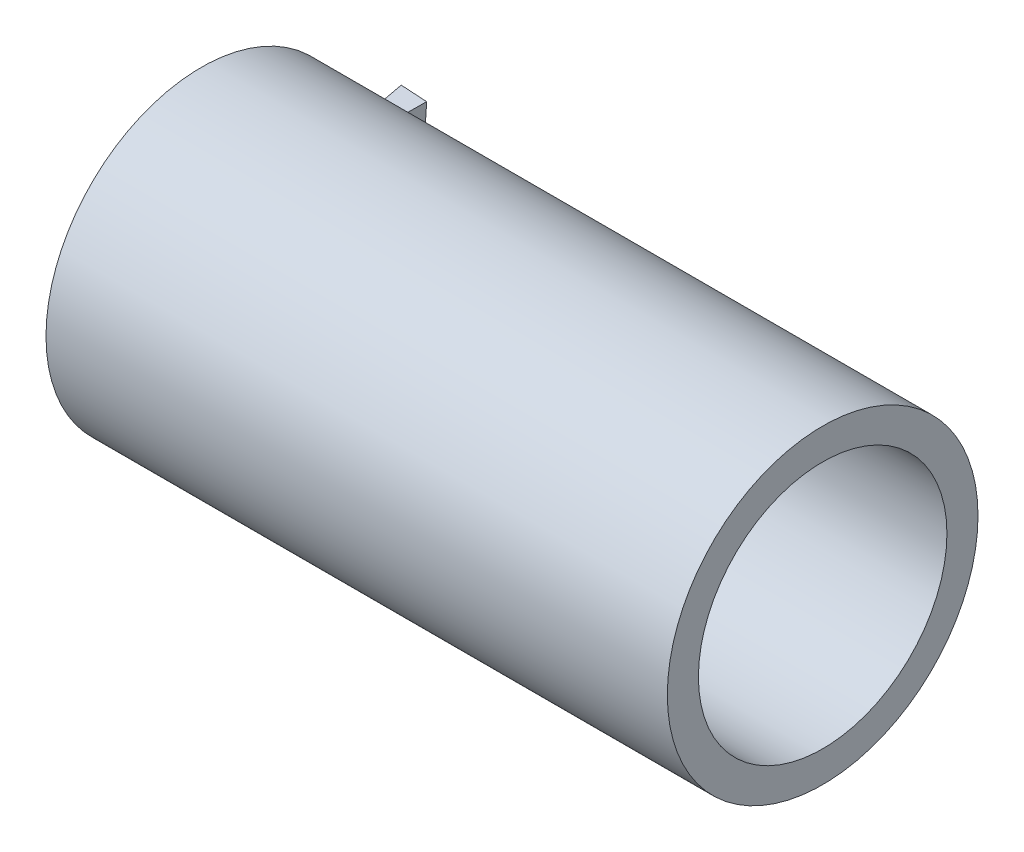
ISO-10303-21;
HEADER;
FILE_DESCRIPTION(('STEP AP214'),'2;1');
FILE_NAME('part.step','',(''),(''),'','','');
FILE_SCHEMA(('AUTOMOTIVE_DESIGN { 1 0 10303 214 1 1 1 1 }'));
ENDSEC;
DATA;
#1=APPLICATION_CONTEXT('core data for automotive mechanical design processes');
#2=APPLICATION_PROTOCOL_DEFINITION('international standard','automotive_design',2000,#1);
#3=PRODUCT_CONTEXT('',#1,'mechanical');
#4=PRODUCT('Part','Part','',(#3));
#5=PRODUCT_RELATED_PRODUCT_CATEGORY('part','',(#4));
#6=PRODUCT_DEFINITION_FORMATION('','',#4);
#7=PRODUCT_DEFINITION_CONTEXT('part definition',#1,'design');
#8=PRODUCT_DEFINITION('design','',#6,#7);
#9=PRODUCT_DEFINITION_SHAPE('','',#8);
#10=(LENGTH_UNIT() NAMED_UNIT(*) SI_UNIT(.MILLI.,.METRE.));
#11=(NAMED_UNIT(*) PLANE_ANGLE_UNIT() SI_UNIT($,.RADIAN.));
#12=(NAMED_UNIT(*) SI_UNIT($,.STERADIAN.) SOLID_ANGLE_UNIT());
#13=UNCERTAINTY_MEASURE_WITH_UNIT(LENGTH_MEASURE(1.E-05),#10,'distance_accuracy_value','');
#14=(GEOMETRIC_REPRESENTATION_CONTEXT(3) GLOBAL_UNCERTAINTY_ASSIGNED_CONTEXT((#13)) GLOBAL_UNIT_ASSIGNED_CONTEXT((#10,
#11,#12)) REPRESENTATION_CONTEXT('',''));
#15=CARTESIAN_POINT('',(0.,0.,0.));
#16=DIRECTION('',(0.,0.,1.));
#17=DIRECTION('',(1.,0.,0.));
#18=AXIS2_PLACEMENT_3D('',#15,#16,#17);
#19=CARTESIAN_POINT('',(0.,20.,0.));
#20=DIRECTION('',(1.,0.,0.));
#21=DIRECTION('',(0.,0.,-1.));
#22=AXIS2_PLACEMENT_3D('',#19,#20,#21);
#23=PLANE('',#22);
#24=CARTESIAN_POINT('',(0.,0.,0.));
#25=DIRECTION('',(1.,0.,0.));
#26=DIRECTION('',(0.,0.,-1.));
#27=AXIS2_PLACEMENT_3D('',#24,#25,#26);
#28=CIRCLE('',#27,25.);
#29=CARTESIAN_POINT('',(0.,0.,-25.));
#30=VERTEX_POINT('',#29);
#31=CARTESIAN_POINT('',(0.,-10.9625472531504,-22.4682566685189));
#32=VERTEX_POINT('',#31);
#33=EDGE_CURVE('E64',#30,#32,#28,.F.);
#34=ORIENTED_EDGE('',*,*,#33,.F.);
#35=DIRECTION('',(0.,0.855797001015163,0.517311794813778));
#36=VECTOR('',#35,1.);
#37=CARTESIAN_POINT('',(0.,-1.92863678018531,-26.1658215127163));
#38=LINE('',#37,#36);
#39=CARTESIAN_POINT('',(9.44111427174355E-06,-1.55724327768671,-25.9414113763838));
#40=VERTEX_POINT('',#39);
#41=EDGE_CURVE('E94',#40,#30,#38,.T.);
#42=ORIENTED_EDGE('',*,*,#41,.F.);
#43=CARTESIAN_POINT('',(0.,-10.9627373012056,-22.469326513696));
#44=CARTESIAN_POINT('',(1.08463683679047E-06,-10.5930481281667,-22.705411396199));
#45=CARTESIAN_POINT('',(1.76324528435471E-05,-10.2166393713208,-22.9309429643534));
#46=CARTESIAN_POINT('',(6.31856095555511E-05,-9.45590871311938,-23.358083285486));
#47=CARTESIAN_POINT('',(9.20522468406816E-05,-9.07171898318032,-23.5599274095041));
#48=CARTESIAN_POINT('',(0.000144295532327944,-8.29718437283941,-23.9399144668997));
#49=CARTESIAN_POINT('',(0.000167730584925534,-7.90695826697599,-24.118299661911));
#50=CARTESIAN_POINT('',(0.000199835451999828,-7.12203124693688,-24.4516559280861));
#51=CARTESIAN_POINT('',(0.000208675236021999,-6.72743651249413,-24.6068770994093));
#52=CARTESIAN_POINT('',(0.000208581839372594,-5.93538064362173,-24.8942412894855));
#53=CARTESIAN_POINT('',(0.000199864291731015,-5.53801329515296,-25.0266428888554));
#54=CARTESIAN_POINT('',(0.000168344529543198,-4.74194545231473,-25.2687544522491));
#55=CARTESIAN_POINT('',(0.00014572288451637,-4.34332621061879,-25.378731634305));
#56=CARTESIAN_POINT('',(9.56847371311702E-05,-3.54621022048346,-25.5764284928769));
#57=CARTESIAN_POINT('',(6.8335741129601E-05,-3.14778183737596,-25.6644237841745));
#58=CARTESIAN_POINT('',(2.59220931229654E-05,-2.35243037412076,-25.8186358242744));
#59=CARTESIAN_POINT('',(1.06933481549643E-05,-1.95556221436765,-25.885135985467));
#60=CARTESIAN_POINT('',(9.44111427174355E-06,-1.55724327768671,-25.9414113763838));
#61=B_SPLINE_CURVE_WITH_KNOTS('',3,(#43,#44,#45,#46,#47,#48,#49,#50,#51,#52,#53,#54,#55,#56,#57,
#58,#59,#60),.UNSPECIFIED.,.F.,.F.,(4,2,2,2,2,2,2,2,4),(0.,1.3157208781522,2.61700285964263,
3.90356596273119,5.17503787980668,6.43098925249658,7.67096474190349,8.89450987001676,
10.1011937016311),.UNSPECIFIED.);
#62=EDGE_CURVE('E57',#40,#32,#61,.F.);
#63=ORIENTED_EDGE('',*,*,#62,.T.);
#64=EDGE_LOOP('',(#34,#42,#63));
#65=FACE_BOUND('',#64,.T.);
#66=ADVANCED_FACE('F44',(#65),#23,.F.);
#67=CARTESIAN_POINT('',(0.150022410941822,2.35654652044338,-25.));
#68=DIRECTION('',(0.0631853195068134,0.992512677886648,0.104528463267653));
#69=DIRECTION('',(0.,-0.104737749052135,0.994499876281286));
#70=AXIS2_PLACEMENT_3D('',#67,#68,#69);
#71=PLANE('',#70);
#72=DIRECTION('',(-0.11035707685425,-0.0971469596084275,0.989132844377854));
#73=VECTOR('',#72,1.);
#74=CARTESIAN_POINT('',(0.0926576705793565,2.30604853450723,-24.4858386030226));
#75=LINE('',#74,#73);
#76=CARTESIAN_POINT('',(0.248480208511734,2.44321858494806,-25.882479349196));
#77=VERTEX_POINT('',#76);
#78=CARTESIAN_POINT('',(0.137717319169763,2.3457143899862,-24.8897091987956));
#79=VERTEX_POINT('',#78);
#80=EDGE_CURVE('E97',#77,#79,#75,.T.);
#81=ORIENTED_EDGE('',*,*,#80,.T.);
#82=CARTESIAN_POINT('',(-4.19132279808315,0.,0.));
#83=DIRECTION('',(0.0631853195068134,0.992512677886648,0.104528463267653));
#84=DIRECTION('',(-0.998001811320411,0.0628377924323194,0.0066178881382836));
#85=AXIS2_PLACEMENT_3D('',#82,#83,#84);
#86=ELLIPSE('',#85,395.661526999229,25.);
#87=CARTESIAN_POINT('',(1.13888310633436,2.28338232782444,-24.8955049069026));
#88=VERTEX_POINT('',#87);
#89=EDGE_CURVE('E84',#79,#88,#86,.F.);
#90=ORIENTED_EDGE('',*,*,#89,.T.);
#91=CARTESIAN_POINT('',(0.248480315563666,2.44321856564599,-25.8824792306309));
#92=CARTESIAN_POINT('',(0.285560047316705,2.43650018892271,-25.8414029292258));
#93=CARTESIAN_POINT('',(0.322639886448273,2.42978571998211,-25.8003260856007));
#94=CARTESIAN_POINT('',(0.396799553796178,2.41636463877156,-25.7181715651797));
#95=CARTESIAN_POINT('',(0.43387938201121,2.40965802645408,-25.6770938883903));
#96=CARTESIAN_POINT('',(0.508039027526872,2.39625265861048,-25.5949377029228));
#97=CARTESIAN_POINT('',(0.545118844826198,2.38955390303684,-25.5538591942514));
#98=CARTESIAN_POINT('',(0.61927846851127,2.37616424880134,-25.4717013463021));
#99=CARTESIAN_POINT('',(0.656358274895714,2.36947335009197,-25.4306220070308));
#100=CARTESIAN_POINT('',(0.730517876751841,2.35609940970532,-25.3484624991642));
#101=CARTESIAN_POINT('',(0.767597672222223,2.34941636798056,-25.3073823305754));
#102=CARTESIAN_POINT('',(0.841757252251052,2.33605814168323,-25.225221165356));
#103=CARTESIAN_POINT('',(0.878837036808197,2.3293829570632,-25.1841401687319));
#104=CARTESIAN_POINT('',(0.952996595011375,2.31604044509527,-25.1019773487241));
#105=CARTESIAN_POINT('',(0.990076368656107,2.30937311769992,-25.0608955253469));
#106=CARTESIAN_POINT('',(1.06423590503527,2.29604632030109,-24.978731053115));
#107=CARTESIAN_POINT('',(1.10131566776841,2.28938685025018,-24.9376484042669));
#108=CARTESIAN_POINT('',(1.13839553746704,2.28273128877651,-24.8965652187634));
#109=B_SPLINE_CURVE_WITH_KNOTS('',3,(#91,#92,#93,#94,#95,#96,#97,#98,#99,#100,#101,#102,#103,
#104,#105,#106,#107,#108),.UNSPECIFIED.,.F.,.F.,(4,2,2,2,2,2,2,2,4),(0.,0.167229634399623,
0.334458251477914,0.501685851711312,0.668912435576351,0.836138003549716,1.00336255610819,
1.1705860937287,1.33780861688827),.UNSPECIFIED.);
#110=EDGE_CURVE('E12',#88,#77,#109,.F.);
#111=ORIENTED_EDGE('',*,*,#110,.T.);
#112=EDGE_LOOP('',(#81,#90,#111));
#113=FACE_BOUND('',#112,.T.);
#114=ADVANCED_FACE('F100',(#113),#71,.T.);
#115=CARTESIAN_POINT('',(-0.0737635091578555,-11.5717078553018,-22.1606763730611));
#116=CARTESIAN_POINT('',(0.472643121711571,-7.13573066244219,-24.4875659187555));
#117=CARTESIAN_POINT('',(0.914647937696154,-1.98976497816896,-25.4283379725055));
#118=CARTESIAN_POINT('',(1.17635278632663,2.9825579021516,-24.8214493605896));
#119=CARTESIAN_POINT('',(-0.964851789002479,-11.9305474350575,-23.0503666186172));
#120=CARTESIAN_POINT('',(-0.418445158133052,-7.33526357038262,-25.4608203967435));
#121=CARTESIAN_POINT('',(0.0235596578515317,-2.00449381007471,-26.4353778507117));
#122=CARTESIAN_POINT('',(0.285264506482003,3.14639721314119,-25.8066944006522));
#123=B_SPLINE_SURFACE_WITH_KNOTS('',1,3,((#115,#116,#117,#118),(#119,#120,#121,#122)),
.UNSPECIFIED.,.F.,.F.,.F.,(2,2),(4,4),(0.,1.),(2.11665757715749,2.71747301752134),.UNSPECIFIED.);
#124=CARTESIAN_POINT('',(1.17635278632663,2.9825579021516,-24.8214493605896));
#125=CARTESIAN_POINT('',(0.914647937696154,-1.98976497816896,-25.4283379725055));
#126=CARTESIAN_POINT('',(0.472643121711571,-7.13573066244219,-24.4875659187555));
#127=CARTESIAN_POINT('',(-0.0737635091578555,-11.5717078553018,-22.1606763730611));
#128=B_SPLINE_CURVE_WITH_KNOTS('',3,(#124,#125,#126,#127),.UNSPECIFIED.,.F.,.F.,(4,4),
(2.11665757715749,2.71747301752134),.UNSPECIFIED.);
#129=EDGE_CURVE('E89',#32,#88,#128,.F.);
#130=CARTESIAN_POINT('',(-0.964851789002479,-11.9305474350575,-23.0503666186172));
#131=CARTESIAN_POINT('',(-0.418445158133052,-7.33526357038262,-25.4608203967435));
#132=CARTESIAN_POINT('',(0.0235596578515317,-2.00449381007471,-26.4353778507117));
#133=CARTESIAN_POINT('',(0.285264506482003,3.14639721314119,-25.8066944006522));
#134=B_SPLINE_CURVE_WITH_KNOTS('',3,(#130,#131,#132,#133),.UNSPECIFIED.,.F.,.F.,(4,4),
(2.11665757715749,2.71747301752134),.UNSPECIFIED.);
#135=EDGE_CURVE('E72',#77,#40,#134,.F.);
#136=ORIENTED_EDGE('',*,*,#110,.F.);
#137=ORIENTED_EDGE('',*,*,#129,.F.);
#138=ORIENTED_EDGE('',*,*,#62,.F.);
#139=ORIENTED_EDGE('',*,*,#135,.F.);
#140=EDGE_LOOP('',(#136,#137,#138,#139));
#141=FACE_BOUND('',#140,.T.);
#142=ADVANCED_FACE('F46',(#141),#123,.T.);
#143=CARTESIAN_POINT('',(-0.167644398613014,-2.63335205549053,-25.));
#144=DIRECTION('',(0.992512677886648,-0.0631853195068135,0.104528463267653));
#145=DIRECTION('',(0.104737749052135,0.,-0.994499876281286));
#146=AXIS2_PLACEMENT_3D('',#143,#144,#145);
#147=PLANE('',#146);
#148=CARTESIAN_POINT('',(-2.63292514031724,0.,0.));
#149=DIRECTION('',(0.992512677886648,-0.0631853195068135,0.104528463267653));
#150=DIRECTION('',(-0.122141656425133,-0.513438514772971,0.849389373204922));
#151=AXIS2_PLACEMENT_3D('',#148,#149,#150);
#152=ELLIPSE('',#151,25.1885951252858,25.);
#153=EDGE_CURVE('E87',#79,#30,#152,.F.);
#154=ORIENTED_EDGE('',*,*,#153,.F.);
#155=ORIENTED_EDGE('',*,*,#80,.F.);
#156=ORIENTED_EDGE('',*,*,#135,.T.);
#157=ORIENTED_EDGE('',*,*,#41,.T.);
#158=EDGE_LOOP('',(#154,#155,#156,#157));
#159=FACE_BOUND('',#158,.T.);
#160=ADVANCED_FACE('F96',(#159),#147,.F.);
#161=CARTESIAN_POINT('',(0.,0.,0.));
#162=DIRECTION('',(-1.,0.,0.));
#163=DIRECTION('',(0.,0.,1.));
#164=AXIS2_PLACEMENT_3D('',#161,#162,#163);
#165=CYLINDRICAL_SURFACE('',#164,25.);
#166=ORIENTED_EDGE('',*,*,#153,.T.);
#167=ORIENTED_EDGE('',*,*,#33,.T.);
#168=ORIENTED_EDGE('',*,*,#129,.T.);
#169=ORIENTED_EDGE('',*,*,#89,.F.);
#170=EDGE_LOOP('',(#166,#167,#168,#169));
#171=FACE_BOUND('',#170,.T.);
#172=ADVANCED_FACE('F86',(#171),#165,.F.);
#173=CLOSED_SHELL('',(#66,#114,#142,#160,#172));
#174=MANIFOLD_SOLID_BREP('B2',#173);
#175=CARTESIAN_POINT('',(-0.167644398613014,-2.63335205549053,-25.));
#176=DIRECTION('',(-0.0631853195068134,-0.992512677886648,0.104528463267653));
#177=DIRECTION('',(0.,-0.104737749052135,-0.994499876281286));
#178=AXIS2_PLACEMENT_3D('',#175,#176,#177);
#179=PLANE('',#178);
#180=DIRECTION('',(0.997979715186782,-0.0635333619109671,0.));
#181=VECTOR('',#180,1.);
#182=CARTESIAN_POINT('',(-0.167644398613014,-2.63335205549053,-25.));
#183=LINE('',#182,#181);
#184=CARTESIAN_POINT('',(-2.16360382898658,-2.5062853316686,-25.));
#185=VERTEX_POINT('',#184);
#186=CARTESIAN_POINT('',(-0.167644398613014,-2.63335205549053,-25.));
#187=VERTEX_POINT('',#186);
#188=EDGE_CURVE('E290',#185,#187,#183,.T.);
#189=ORIENTED_EDGE('',*,*,#188,.F.);
#190=DIRECTION('',(0.11035707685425,0.0971469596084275,0.989132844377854));
#191=VECTOR('',#190,1.);
#192=CARTESIAN_POINT('',(-2.16360382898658,-2.5062853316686,-25.));
#193=LINE('',#192,#191);
#194=CARTESIAN_POINT('',(-3.27929903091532,-3.48842802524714,-35.));
#195=VERTEX_POINT('',#194);
#196=EDGE_CURVE('E42',#195,#185,#193,.T.);
#197=ORIENTED_EDGE('',*,*,#196,.F.);
#198=DIRECTION('',(0.997979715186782,-0.0635333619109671,0.));
#199=VECTOR('',#198,1.);
#200=CARTESIAN_POINT('',(-0.23442065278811,-3.68227100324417,-35.));
#201=LINE('',#200,#199);
#202=CARTESIAN_POINT('',(0.814498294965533,-3.74904725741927,-35.));
#203=VERTEX_POINT('',#202);
#204=EDGE_CURVE('E292',#195,#203,#201,.T.);
#205=ORIENTED_EDGE('',*,*,#204,.T.);
#206=DIRECTION('',(-0.0971469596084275,0.11035707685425,0.989132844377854));
#207=VECTOR('',#206,1.);
#208=CARTESIAN_POINT('',(-0.167644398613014,-2.63335205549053,-25.));
#209=LINE('',#208,#207);
#210=EDGE_CURVE('E277',#203,#187,#209,.T.);
#211=ORIENTED_EDGE('',*,*,#210,.T.);
#212=EDGE_LOOP('',(#189,#197,#205,#211));
#213=FACE_BOUND('',#212,.T.);
#214=ADVANCED_FACE('F240',(#213),#179,.T.);
#215=CARTESIAN_POINT('',(-2.16360382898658,-2.5062853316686,-25.));
#216=DIRECTION('',(-0.992512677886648,0.0631853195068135,0.104528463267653));
#217=DIRECTION('',(0.104737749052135,0.,0.994499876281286));
#218=AXIS2_PLACEMENT_3D('',#215,#216,#217);
#219=PLANE('',#218);
#220=DIRECTION('',(-0.0635333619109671,-0.997979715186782,0.));
#221=VECTOR('',#220,1.);
#222=CARTESIAN_POINT('',(-2.16360382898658,-2.5062853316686,-25.));
#223=LINE('',#222,#221);
#224=CARTESIAN_POINT('',(-1.84593701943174,2.48361324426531,-25.));
#225=VERTEX_POINT('',#224);
#226=EDGE_CURVE('E302',#225,#185,#223,.T.);
#227=ORIENTED_EDGE('',*,*,#226,.F.);
#228=DIRECTION('',(0.0971469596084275,-0.11035707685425,0.989132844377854));
#229=VECTOR('',#228,1.);
#230=CARTESIAN_POINT('',(-1.82573782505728,2.46066734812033,-24.794335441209));
#231=LINE('',#230,#229);
#232=CARTESIAN_POINT('',(-2.82807971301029,3.59930844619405,-35.));
#233=VERTEX_POINT('',#232);
#234=EDGE_CURVE('E250',#233,#225,#231,.T.);
#235=ORIENTED_EDGE('',*,*,#234,.F.);
#236=DIRECTION('',(-0.0635333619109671,-0.997979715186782,0.));
#237=VECTOR('',#236,1.);
#238=CARTESIAN_POINT('',(-3.21252277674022,-2.4395090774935,-35.));
#239=LINE('',#238,#237);
#240=EDGE_CURVE('E293',#233,#195,#239,.T.);
#241=ORIENTED_EDGE('',*,*,#240,.T.);
#242=ORIENTED_EDGE('',*,*,#196,.T.);
#243=EDGE_LOOP('',(#227,#235,#241,#242));
#244=FACE_BOUND('',#243,.T.);
#245=ADVANCED_FACE('F242',(#244),#219,.T.);
#246=CARTESIAN_POINT('',(0.150022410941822,2.35654652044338,-25.));
#247=DIRECTION('',(0.0631853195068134,0.992512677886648,0.104528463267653));
#248=DIRECTION('',(0.,-0.104737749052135,0.994499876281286));
#249=AXIS2_PLACEMENT_3D('',#246,#247,#248);
#250=PLANE('',#249);
#251=DIRECTION('',(-0.997979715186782,0.0635333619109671,0.));
#252=VECTOR('',#251,1.);
#253=CARTESIAN_POINT('',(0.150022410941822,2.35654652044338,-25.));
#254=LINE('',#253,#252);
#255=CARTESIAN_POINT('',(0.150022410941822,2.35654652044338,-25.));
#256=VERTEX_POINT('',#255);
#257=EDGE_CURVE('E299',#256,#225,#254,.T.);
#258=ORIENTED_EDGE('',*,*,#257,.F.);
#259=DIRECTION('',(-0.11035707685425,-0.0971469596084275,0.989132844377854));
#260=VECTOR('',#259,1.);
#261=CARTESIAN_POINT('',(0.0926576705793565,2.30604853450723,-24.4858386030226));
#262=LINE('',#261,#260);
#263=CARTESIAN_POINT('',(1.26571761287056,3.33868921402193,-35.));
#264=VERTEX_POINT('',#263);
#265=EDGE_CURVE('E270',#264,#256,#262,.T.);
#266=ORIENTED_EDGE('',*,*,#265,.F.);
#267=DIRECTION('',(-0.997979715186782,0.0635333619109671,0.));
#268=VECTOR('',#267,1.);
#269=CARTESIAN_POINT('',(0.216798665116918,3.40546546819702,-35.));
#270=LINE('',#269,#268);
#271=EDGE_CURVE('E310',#264,#233,#270,.T.);
#272=ORIENTED_EDGE('',*,*,#271,.T.);
#273=ORIENTED_EDGE('',*,*,#234,.T.);
#274=EDGE_LOOP('',(#258,#266,#272,#273));
#275=FACE_BOUND('',#274,.T.);
#276=ADVANCED_FACE('F315',(#275),#250,.T.);
#277=CARTESIAN_POINT('',(-0.167644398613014,-2.63335205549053,-25.));
#278=DIRECTION('',(0.992512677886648,-0.0631853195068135,0.104528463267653));
#279=DIRECTION('',(0.104737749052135,0.,-0.994499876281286));
#280=AXIS2_PLACEMENT_3D('',#277,#278,#279);
#281=PLANE('',#280);
#282=DIRECTION('',(0.0635333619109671,0.997979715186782,0.));
#283=VECTOR('',#282,1.);
#284=CARTESIAN_POINT('',(-0.167644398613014,-2.63335205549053,-25.));
#285=LINE('',#284,#283);
#286=EDGE_CURVE('E296',#187,#256,#285,.T.);
#287=ORIENTED_EDGE('',*,*,#286,.F.);
#288=ORIENTED_EDGE('',*,*,#210,.F.);
#289=DIRECTION('',(0.0635333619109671,0.997979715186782,0.));
#290=VECTOR('',#289,1.);
#291=CARTESIAN_POINT('',(0.88127454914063,-2.70012830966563,-35.));
#292=LINE('',#291,#290);
#293=EDGE_CURVE('E244',#203,#264,#292,.T.);
#294=ORIENTED_EDGE('',*,*,#293,.T.);
#295=ORIENTED_EDGE('',*,*,#265,.T.);
#296=EDGE_LOOP('',(#287,#288,#294,#295));
#297=FACE_BOUND('',#296,.T.);
#298=ADVANCED_FACE('F297',(#297),#281,.T.);
#299=CARTESIAN_POINT('',(-2.16360382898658,-2.5062853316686,-35.));
#300=DIRECTION('',(0.,0.,-1.));
#301=DIRECTION('',(-1.,0.,0.));
#302=AXIS2_PLACEMENT_3D('',#299,#300,#301);
#303=PLANE('',#302);
#304=ORIENTED_EDGE('',*,*,#204,.F.);
#305=ORIENTED_EDGE('',*,*,#240,.F.);
#306=ORIENTED_EDGE('',*,*,#271,.F.);
#307=ORIENTED_EDGE('',*,*,#293,.F.);
#308=EDGE_LOOP('',(#304,#305,#306,#307));
#309=FACE_BOUND('',#308,.T.);
#310=ADVANCED_FACE('F313',(#309),#303,.T.);
#311=CARTESIAN_POINT('',(-2.16360382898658,-2.5062853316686,-25.));
#312=DIRECTION('',(0.,0.,-1.));
#313=DIRECTION('',(-1.,0.,0.));
#314=AXIS2_PLACEMENT_3D('',#311,#312,#313);
#315=PLANE('',#314);
#316=ORIENTED_EDGE('',*,*,#188,.T.);
#317=ORIENTED_EDGE('',*,*,#286,.T.);
#318=ORIENTED_EDGE('',*,*,#257,.T.);
#319=ORIENTED_EDGE('',*,*,#226,.T.);
#320=EDGE_LOOP('',(#316,#317,#318,#319));
#321=FACE_BOUND('',#320,.T.);
#322=ADVANCED_FACE('F301',(#321),#315,.F.);
#323=CLOSED_SHELL('',(#214,#245,#276,#298,#310,#322));
#324=MANIFOLD_SOLID_BREP('B6',#323);
#325=CARTESIAN_POINT('',(0.,20.,0.));
#326=DIRECTION('',(1.,0.,0.));
#327=DIRECTION('',(0.,0.,-1.));
#328=AXIS2_PLACEMENT_3D('',#325,#326,#327);
#329=PLANE('',#328);
#330=CARTESIAN_POINT('',(0.,0.,0.));
#331=DIRECTION('',(-1.,0.,0.));
#332=DIRECTION('',(0.,0.,1.));
#333=AXIS2_PLACEMENT_3D('',#330,#331,#332);
#334=CIRCLE('',#333,20.);
#335=CARTESIAN_POINT('',(0.,0.,20.));
#336=VERTEX_POINT('',#335);
#337=EDGE_CURVE('E378',#336,#336,#334,.T.);
#338=ORIENTED_EDGE('',*,*,#337,.F.);
#339=EDGE_LOOP('',(#338));
#340=FACE_BOUND('',#339,.T.);
#341=CARTESIAN_POINT('',(0.,0.,0.));
#342=DIRECTION('',(-1.,0.,0.));
#343=DIRECTION('',(0.,0.,1.));
#344=AXIS2_PLACEMENT_3D('',#341,#342,#343);
#345=CIRCLE('',#344,25.);
#346=CARTESIAN_POINT('',(0.,0.,25.));
#347=VERTEX_POINT('',#346);
#348=EDGE_CURVE('E239',#347,#347,#345,.T.);
#349=ORIENTED_EDGE('',*,*,#348,.T.);
#350=EDGE_LOOP('',(#349));
#351=FACE_BOUND('',#350,.T.);
#352=ADVANCED_FACE('F364',(#340,#351),#329,.F.);
#353=CARTESIAN_POINT('',(0.,0.,0.));
#354=DIRECTION('',(-1.,0.,0.));
#355=DIRECTION('',(0.,0.,1.));
#356=AXIS2_PLACEMENT_3D('',#353,#354,#355);
#357=CYLINDRICAL_SURFACE('',#356,25.);
#358=ORIENTED_EDGE('',*,*,#348,.F.);
#359=EDGE_LOOP('',(#358));
#360=FACE_BOUND('',#359,.T.);
#361=CARTESIAN_POINT('',(100.,0.,0.));
#362=DIRECTION('',(-1.,0.,0.));
#363=DIRECTION('',(0.,0.,1.));
#364=AXIS2_PLACEMENT_3D('',#361,#362,#363);
#365=CIRCLE('',#364,25.);
#366=CARTESIAN_POINT('',(100.,0.,25.));
#367=VERTEX_POINT('',#366);
#368=EDGE_CURVE('E370',#367,#367,#365,.T.);
#369=ORIENTED_EDGE('',*,*,#368,.T.);
#370=EDGE_LOOP('',(#369));
#371=FACE_BOUND('',#370,.T.);
#372=ADVANCED_FACE('F387',(#360,#371),#357,.T.);
#373=CARTESIAN_POINT('',(100.,20.,0.));
#374=DIRECTION('',(-1.,0.,0.));
#375=DIRECTION('',(0.,0.,1.));
#376=AXIS2_PLACEMENT_3D('',#373,#374,#375);
#377=PLANE('',#376);
#378=ORIENTED_EDGE('',*,*,#368,.F.);
#379=EDGE_LOOP('',(#378));
#380=FACE_BOUND('',#379,.T.);
#381=CARTESIAN_POINT('',(100.,0.,0.));
#382=DIRECTION('',(-1.,0.,0.));
#383=DIRECTION('',(0.,0.,1.));
#384=AXIS2_PLACEMENT_3D('',#381,#382,#383);
#385=CIRCLE('',#384,20.);
#386=CARTESIAN_POINT('',(100.,0.,20.));
#387=VERTEX_POINT('',#386);
#388=EDGE_CURVE('E374',#387,#387,#385,.T.);
#389=ORIENTED_EDGE('',*,*,#388,.T.);
#390=EDGE_LOOP('',(#389));
#391=FACE_BOUND('',#390,.T.);
#392=ADVANCED_FACE('F391',(#380,#391),#377,.F.);
#393=CARTESIAN_POINT('',(0.,0.,0.));
#394=DIRECTION('',(-1.,0.,0.));
#395=DIRECTION('',(0.,0.,1.));
#396=AXIS2_PLACEMENT_3D('',#393,#394,#395);
#397=CYLINDRICAL_SURFACE('',#396,20.);
#398=ORIENTED_EDGE('',*,*,#388,.F.);
#399=EDGE_LOOP('',(#398));
#400=FACE_BOUND('',#399,.T.);
#401=ORIENTED_EDGE('',*,*,#337,.T.);
#402=EDGE_LOOP('',(#401));
#403=FACE_BOUND('',#402,.T.);
#404=ADVANCED_FACE('F384',(#400,#403),#397,.F.);
#405=CLOSED_SHELL('',(#352,#372,#392,#404));
#406=MANIFOLD_SOLID_BREP('B36',#405);
#407=ADVANCED_BREP_SHAPE_REPRESENTATION('',(#18,#174,#324,#406),#14);
#408=SHAPE_DEFINITION_REPRESENTATION(#9,#407);
ENDSEC;
END-ISO-10303-21;
